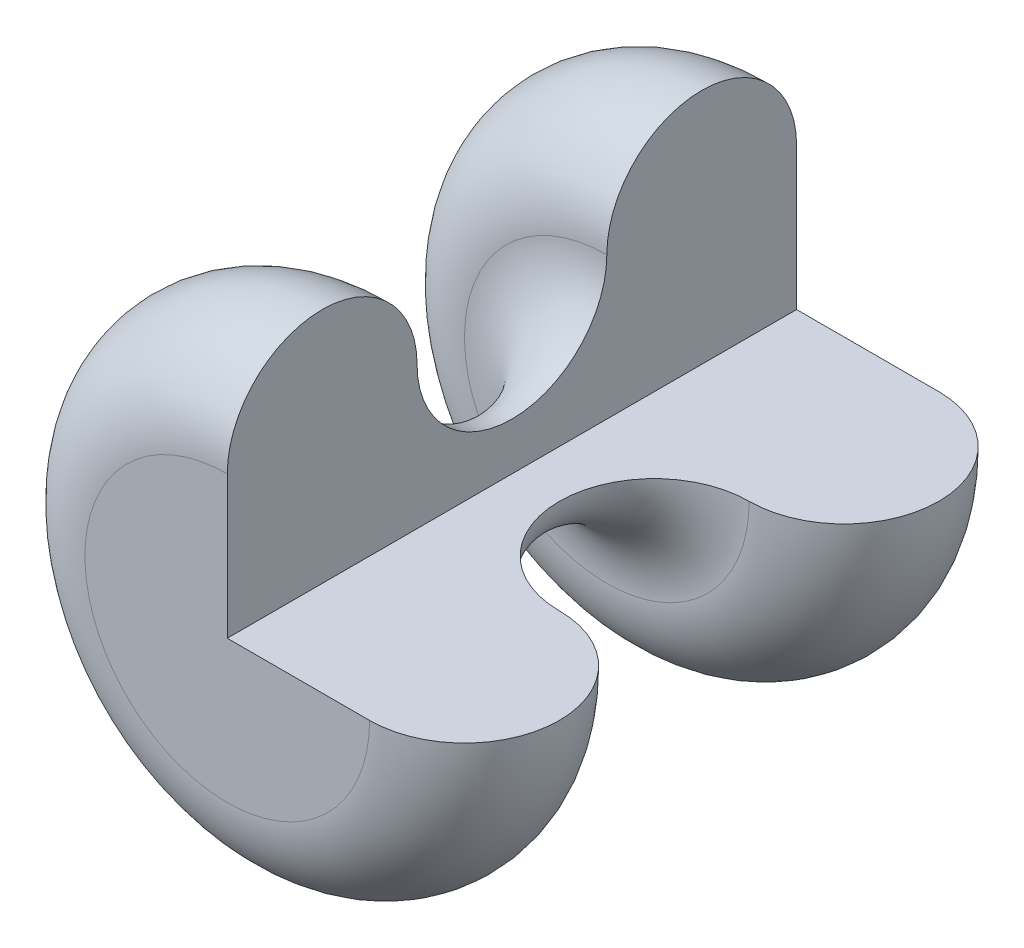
from build123d import *

# Parameters (mm, degrees)
BASE_REVOLVE_ANGLE = 270


with BuildPart() as part:
    # Sketch1 → Base-Revolve (revolve)
    with BuildSketch(Plane(origin=(0, 0, 0), x_dir=(1, 0, 0), z_dir=(0, 1, 0))):
        with BuildLine():
            Line((0, -24.362256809), (30.242801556, -24.362256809))
            ThreePointArc((30.242801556, -24.362256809), (50.404669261, -4.200389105), (30.242801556, 15.961478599))
            ThreePointArc((30.242801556, 15.961478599), (10.080933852, 36.123346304), (30.242801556, 56.285214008))
            ThreePointArc((30.242801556, 56.285214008), (50.404669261, 76.447081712), (30.242801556, 96.608949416))
            Line((30.242801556, 96.608949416), (0, 96.608949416))
            Line((0, 96.608949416), (0, -24.362256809))
        make_face()
    revolve(axis=Axis((0, 0, -104.169649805), (0, 0, -1)), revolution_arc=BASE_REVOLVE_ANGLE)


solid = part.part
